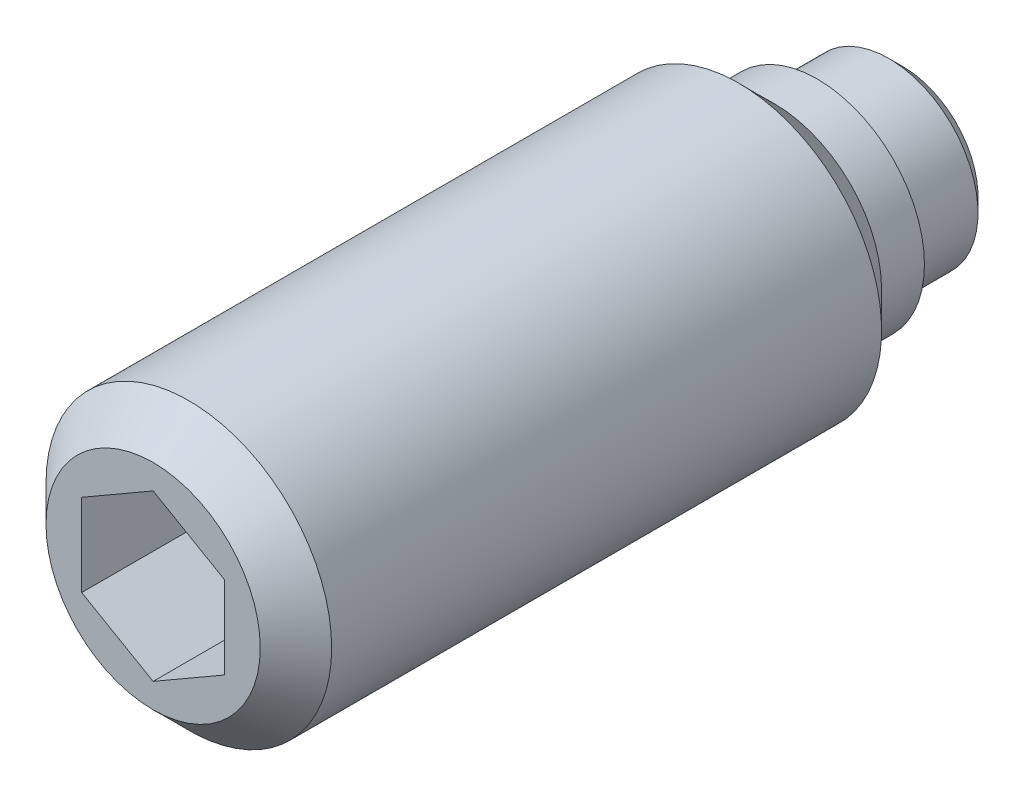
ISO-10303-21;
HEADER;
FILE_DESCRIPTION(('STEP AP214'),'2;1');
FILE_NAME('part.step','',(''),(''),'','','');
FILE_SCHEMA(('AUTOMOTIVE_DESIGN { 1 0 10303 214 1 1 1 1 }'));
ENDSEC;
DATA;
#1=APPLICATION_CONTEXT('core data for automotive mechanical design processes');
#2=APPLICATION_PROTOCOL_DEFINITION('international standard','automotive_design',2000,#1);
#3=PRODUCT_CONTEXT('',#1,'mechanical');
#4=PRODUCT('Part','Part','',(#3));
#5=PRODUCT_RELATED_PRODUCT_CATEGORY('part','',(#4));
#6=PRODUCT_DEFINITION_FORMATION('','',#4);
#7=PRODUCT_DEFINITION_CONTEXT('part definition',#1,'design');
#8=PRODUCT_DEFINITION('design','',#6,#7);
#9=PRODUCT_DEFINITION_SHAPE('','',#8);
#10=(LENGTH_UNIT() NAMED_UNIT(*) SI_UNIT(.MILLI.,.METRE.));
#11=(NAMED_UNIT(*) PLANE_ANGLE_UNIT() SI_UNIT($,.RADIAN.));
#12=(NAMED_UNIT(*) SI_UNIT($,.STERADIAN.) SOLID_ANGLE_UNIT());
#13=UNCERTAINTY_MEASURE_WITH_UNIT(LENGTH_MEASURE(1.E-05),#10,'distance_accuracy_value','');
#14=(GEOMETRIC_REPRESENTATION_CONTEXT(3) GLOBAL_UNCERTAINTY_ASSIGNED_CONTEXT((#13)) GLOBAL_UNIT_ASSIGNED_CONTEXT((#10,
#11,#12)) REPRESENTATION_CONTEXT('',''));
#15=CARTESIAN_POINT('',(0.,0.,0.));
#16=DIRECTION('',(0.,0.,1.));
#17=DIRECTION('',(1.,0.,0.));
#18=AXIS2_PLACEMENT_3D('',#15,#16,#17);
#19=CARTESIAN_POINT('',(0.,0.,1.2));
#20=DIRECTION('',(0.,0.,-1.));
#21=DIRECTION('',(-1.,0.,0.));
#22=AXIS2_PLACEMENT_3D('',#19,#20,#21);
#23=CYLINDRICAL_SURFACE('',#22,2.);
#24=CARTESIAN_POINT('',(0.,0.,2.3));
#25=DIRECTION('',(0.,0.,-1.));
#26=DIRECTION('',(-1.,0.,0.));
#27=AXIS2_PLACEMENT_3D('',#24,#25,#26);
#28=CIRCLE('',#27,2.);
#29=CARTESIAN_POINT('',(-2.,0.,2.3));
#30=VERTEX_POINT('',#29);
#31=EDGE_CURVE('E9',#30,#30,#28,.T.);
#32=ORIENTED_EDGE('',*,*,#31,.F.);
#33=EDGE_LOOP('',(#32));
#34=FACE_BOUND('',#33,.T.);
#35=CARTESIAN_POINT('',(0.,0.,10.));
#36=DIRECTION('',(0.,0.,1.));
#37=DIRECTION('',(1.,0.,0.));
#38=AXIS2_PLACEMENT_3D('',#35,#36,#37);
#39=CIRCLE('',#38,2.);
#40=CARTESIAN_POINT('',(2.,0.,10.));
#41=VERTEX_POINT('',#40);
#42=EDGE_CURVE('E70',#41,#41,#39,.T.);
#43=ORIENTED_EDGE('',*,*,#42,.F.);
#44=EDGE_LOOP('',(#43));
#45=FACE_BOUND('',#44,.T.);
#46=ADVANCED_FACE('F14',(#34,#45),#23,.T.);
#47=CARTESIAN_POINT('',(0.,0.,2.3));
#48=DIRECTION('',(0.,0.,1.));
#49=DIRECTION('',(1.,0.,0.));
#50=AXIS2_PLACEMENT_3D('',#47,#48,#49);
#51=CONICAL_SURFACE('',#50,2.,0.785398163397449);
#52=ORIENTED_EDGE('',*,*,#31,.T.);
#53=EDGE_LOOP('',(#52));
#54=FACE_BOUND('',#53,.T.);
#55=CARTESIAN_POINT('',(0.,0.,1.8));
#56=DIRECTION('',(0.,0.,-1.));
#57=DIRECTION('',(-1.,0.,0.));
#58=AXIS2_PLACEMENT_3D('',#55,#56,#57);
#59=CIRCLE('',#58,1.5);
#60=CARTESIAN_POINT('',(-1.5,0.,1.8));
#61=VERTEX_POINT('',#60);
#62=EDGE_CURVE('E21',#61,#61,#59,.T.);
#63=ORIENTED_EDGE('',*,*,#62,.F.);
#64=EDGE_LOOP('',(#63));
#65=FACE_BOUND('',#64,.T.);
#66=ADVANCED_FACE('F138',(#54,#65),#51,.T.);
#67=CARTESIAN_POINT('',(0.,0.,1.2));
#68=DIRECTION('',(0.,0.,-1.));
#69=DIRECTION('',(-1.,0.,0.));
#70=AXIS2_PLACEMENT_3D('',#67,#68,#69);
#71=CYLINDRICAL_SURFACE('',#70,1.5);
#72=CARTESIAN_POINT('',(0.,0.,1.2));
#73=DIRECTION('',(0.,0.,-1.));
#74=DIRECTION('',(-1.,0.,0.));
#75=AXIS2_PLACEMENT_3D('',#72,#73,#74);
#76=CIRCLE('',#75,1.5);
#77=CARTESIAN_POINT('',(-1.5,0.,1.2));
#78=VERTEX_POINT('',#77);
#79=EDGE_CURVE('E131',#78,#78,#76,.T.);
#80=ORIENTED_EDGE('',*,*,#79,.F.);
#81=EDGE_LOOP('',(#80));
#82=FACE_BOUND('',#81,.T.);
#83=ORIENTED_EDGE('',*,*,#62,.T.);
#84=EDGE_LOOP('',(#83));
#85=FACE_BOUND('',#84,.T.);
#86=ADVANCED_FACE('F136',(#82,#85),#71,.T.);
#87=CARTESIAN_POINT('',(0.,1.5,1.2));
#88=DIRECTION('',(0.,0.,1.));
#89=DIRECTION('',(1.,0.,0.));
#90=AXIS2_PLACEMENT_3D('',#87,#88,#89);
#91=PLANE('',#90);
#92=CARTESIAN_POINT('',(0.,0.,1.2));
#93=DIRECTION('',(0.,0.,-1.));
#94=DIRECTION('',(-1.,0.,0.));
#95=AXIS2_PLACEMENT_3D('',#92,#93,#94);
#96=CIRCLE('',#95,1.25);
#97=CARTESIAN_POINT('',(-1.25,0.,1.2));
#98=VERTEX_POINT('',#97);
#99=EDGE_CURVE('E128',#98,#98,#96,.T.);
#100=ORIENTED_EDGE('',*,*,#99,.F.);
#101=EDGE_LOOP('',(#100));
#102=FACE_BOUND('',#101,.T.);
#103=ORIENTED_EDGE('',*,*,#79,.T.);
#104=EDGE_LOOP('',(#103));
#105=FACE_BOUND('',#104,.T.);
#106=ADVANCED_FACE('F146',(#102,#105),#91,.F.);
#107=CARTESIAN_POINT('',(0.,0.,0.));
#108=DIRECTION('',(0.,0.,-1.));
#109=DIRECTION('',(-1.,0.,0.));
#110=AXIS2_PLACEMENT_3D('',#107,#108,#109);
#111=CYLINDRICAL_SURFACE('',#110,1.25);
#112=CARTESIAN_POINT('',(0.,0.,0.2));
#113=DIRECTION('',(0.,0.,-1.));
#114=DIRECTION('',(-1.,0.,0.));
#115=AXIS2_PLACEMENT_3D('',#112,#113,#114);
#116=CIRCLE('',#115,1.25);
#117=CARTESIAN_POINT('',(-1.25,0.,0.2));
#118=VERTEX_POINT('',#117);
#119=EDGE_CURVE('E125',#118,#118,#116,.T.);
#120=ORIENTED_EDGE('',*,*,#119,.F.);
#121=EDGE_LOOP('',(#120));
#122=FACE_BOUND('',#121,.T.);
#123=ORIENTED_EDGE('',*,*,#99,.T.);
#124=EDGE_LOOP('',(#123));
#125=FACE_BOUND('',#124,.T.);
#126=ADVANCED_FACE('F153',(#122,#125),#111,.T.);
#127=CARTESIAN_POINT('',(0.,0.,0.2));
#128=DIRECTION('',(0.,0.,1.));
#129=DIRECTION('',(1.,0.,0.));
#130=AXIS2_PLACEMENT_3D('',#127,#128,#129);
#131=CONICAL_SURFACE('',#130,1.25,0.785398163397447);
#132=CARTESIAN_POINT('',(0.,0.,0.));
#133=DIRECTION('',(0.,0.,-1.));
#134=DIRECTION('',(-1.,0.,0.));
#135=AXIS2_PLACEMENT_3D('',#132,#133,#134);
#136=CIRCLE('',#135,1.05);
#137=CARTESIAN_POINT('',(-1.05,0.,0.));
#138=VERTEX_POINT('',#137);
#139=EDGE_CURVE('E122',#138,#138,#136,.T.);
#140=ORIENTED_EDGE('',*,*,#139,.F.);
#141=EDGE_LOOP('',(#140));
#142=FACE_BOUND('',#141,.T.);
#143=ORIENTED_EDGE('',*,*,#119,.T.);
#144=EDGE_LOOP('',(#143));
#145=FACE_BOUND('',#144,.T.);
#146=ADVANCED_FACE('F157',(#142,#145),#131,.T.);
#147=CARTESIAN_POINT('',(0.,1.05,0.));
#148=DIRECTION('',(0.,0.,1.));
#149=DIRECTION('',(1.,0.,0.));
#150=AXIS2_PLACEMENT_3D('',#147,#148,#149);
#151=PLANE('',#150);
#152=ORIENTED_EDGE('',*,*,#139,.T.);
#153=EDGE_LOOP('',(#152));
#154=FACE_BOUND('',#153,.T.);
#155=ADVANCED_FACE('F161',(#154),#151,.F.);
#156=CARTESIAN_POINT('',(0.,0.,10.5));
#157=DIRECTION('',(0.,0.,1.));
#158=DIRECTION('',(1.,0.,0.));
#159=AXIS2_PLACEMENT_3D('',#156,#157,#158);
#160=PLANE('',#159);
#161=DIRECTION('',(0.866025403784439,-0.5,0.));
#162=VECTOR('',#161,1.);
#163=CARTESIAN_POINT('',(-1.,-0.577350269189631,10.5));
#164=LINE('',#163,#162);
#165=CARTESIAN_POINT('',(-1.,-0.577350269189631,10.5));
#166=VERTEX_POINT('',#165);
#167=CARTESIAN_POINT('',(0.,-1.15470053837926,10.5));
#168=VERTEX_POINT('',#167);
#169=EDGE_CURVE('E28',#166,#168,#164,.T.);
#170=ORIENTED_EDGE('',*,*,#169,.F.);
#171=DIRECTION('',(0.,-1.,0.));
#172=VECTOR('',#171,1.);
#173=CARTESIAN_POINT('',(-1.,0.577350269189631,10.5));
#174=LINE('',#173,#172);
#175=CARTESIAN_POINT('',(-1.,0.577350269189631,10.5));
#176=VERTEX_POINT('',#175);
#177=EDGE_CURVE('E69',#176,#166,#174,.T.);
#178=ORIENTED_EDGE('',*,*,#177,.F.);
#179=DIRECTION('',(-0.866025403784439,-0.5,0.));
#180=VECTOR('',#179,1.);
#181=CARTESIAN_POINT('',(0.,1.15470053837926,10.5));
#182=LINE('',#181,#180);
#183=CARTESIAN_POINT('',(0.,1.15470053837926,10.5));
#184=VERTEX_POINT('',#183);
#185=EDGE_CURVE('E105',#184,#176,#182,.T.);
#186=ORIENTED_EDGE('',*,*,#185,.F.);
#187=DIRECTION('',(-0.866025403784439,0.5,0.));
#188=VECTOR('',#187,1.);
#189=CARTESIAN_POINT('',(1.,0.577350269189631,10.5));
#190=LINE('',#189,#188);
#191=CARTESIAN_POINT('',(1.,0.577350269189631,10.5));
#192=VERTEX_POINT('',#191);
#193=EDGE_CURVE('E102',#192,#184,#190,.T.);
#194=ORIENTED_EDGE('',*,*,#193,.F.);
#195=DIRECTION('',(0.,1.,0.));
#196=VECTOR('',#195,1.);
#197=CARTESIAN_POINT('',(1.,-0.577350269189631,10.5));
#198=LINE('',#197,#196);
#199=CARTESIAN_POINT('',(1.,-0.577350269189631,10.5));
#200=VERTEX_POINT('',#199);
#201=EDGE_CURVE('E99',#200,#192,#198,.T.);
#202=ORIENTED_EDGE('',*,*,#201,.F.);
#203=DIRECTION('',(0.866025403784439,0.5,0.));
#204=VECTOR('',#203,1.);
#205=CARTESIAN_POINT('',(0.,-1.15470053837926,10.5));
#206=LINE('',#205,#204);
#207=EDGE_CURVE('E96',#168,#200,#206,.T.);
#208=ORIENTED_EDGE('',*,*,#207,.F.);
#209=EDGE_LOOP('',(#170,#178,#186,#194,#202,#208));
#210=FACE_BOUND('',#209,.T.);
#211=CARTESIAN_POINT('',(0.,0.,10.5));
#212=DIRECTION('',(0.,0.,1.));
#213=DIRECTION('',(1.,0.,0.));
#214=AXIS2_PLACEMENT_3D('',#211,#212,#213);
#215=CIRCLE('',#214,1.5);
#216=CARTESIAN_POINT('',(1.5,0.,10.5));
#217=VERTEX_POINT('',#216);
#218=EDGE_CURVE('E119',#217,#217,#215,.T.);
#219=ORIENTED_EDGE('',*,*,#218,.T.);
#220=EDGE_LOOP('',(#219));
#221=FACE_BOUND('',#220,.T.);
#222=ADVANCED_FACE('F165',(#210,#221),#160,.T.);
#223=CARTESIAN_POINT('',(0.,0.,10.5));
#224=DIRECTION('',(0.,0.,-1.));
#225=DIRECTION('',(-1.,0.,0.));
#226=AXIS2_PLACEMENT_3D('',#223,#224,#225);
#227=CONICAL_SURFACE('',#226,1.5,0.785398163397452);
#228=ORIENTED_EDGE('',*,*,#42,.T.);
#229=EDGE_LOOP('',(#228));
#230=FACE_BOUND('',#229,.T.);
#231=ORIENTED_EDGE('',*,*,#218,.F.);
#232=EDGE_LOOP('',(#231));
#233=FACE_BOUND('',#232,.T.);
#234=ADVANCED_FACE('F169',(#230,#233),#227,.T.);
#235=CARTESIAN_POINT('',(-1.,-0.577350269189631,8.5));
#236=DIRECTION('',(-0.5,-0.866025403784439,0.));
#237=DIRECTION('',(0.866025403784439,-0.5,0.));
#238=AXIS2_PLACEMENT_3D('',#235,#236,#237);
#239=PLANE('',#238);
#240=ORIENTED_EDGE('',*,*,#169,.T.);
#241=DIRECTION('',(0.,0.,1.));
#242=VECTOR('',#241,1.);
#243=CARTESIAN_POINT('',(0.,-1.15470053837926,8.5));
#244=LINE('',#243,#242);
#245=CARTESIAN_POINT('',(0.,-1.15470053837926,8.));
#246=VERTEX_POINT('',#245);
#247=EDGE_CURVE('E76',#246,#168,#244,.T.);
#248=ORIENTED_EDGE('',*,*,#247,.F.);
#249=DIRECTION('',(0.866025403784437,-0.5,0.));
#250=VECTOR('',#249,1.);
#251=CARTESIAN_POINT('',(-1.,-0.577350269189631,8.));
#252=LINE('',#251,#250);
#253=CARTESIAN_POINT('',(-1.,-0.577350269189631,8.));
#254=VERTEX_POINT('',#253);
#255=EDGE_CURVE('E74',#254,#246,#252,.T.);
#256=ORIENTED_EDGE('',*,*,#255,.F.);
#257=DIRECTION('',(0.,0.,1.));
#258=VECTOR('',#257,1.);
#259=CARTESIAN_POINT('',(-1.,-0.577350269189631,8.5));
#260=LINE('',#259,#258);
#261=EDGE_CURVE('E33',#254,#166,#260,.T.);
#262=ORIENTED_EDGE('',*,*,#261,.T.);
#263=EDGE_LOOP('',(#240,#248,#256,#262));
#264=FACE_BOUND('',#263,.T.);
#265=ADVANCED_FACE('F75',(#264),#239,.F.);
#266=CARTESIAN_POINT('',(-1.,0.577350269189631,8.5));
#267=DIRECTION('',(-1.,0.,0.));
#268=DIRECTION('',(0.,0.,1.));
#269=AXIS2_PLACEMENT_3D('',#266,#267,#268);
#270=PLANE('',#269);
#271=ORIENTED_EDGE('',*,*,#177,.T.);
#272=ORIENTED_EDGE('',*,*,#261,.F.);
#273=DIRECTION('',(0.,-1.,0.));
#274=VECTOR('',#273,1.);
#275=CARTESIAN_POINT('',(-1.,0.577350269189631,8.));
#276=LINE('',#275,#274);
#277=CARTESIAN_POINT('',(-1.,0.577350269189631,8.));
#278=VERTEX_POINT('',#277);
#279=EDGE_CURVE('E66',#278,#254,#276,.T.);
#280=ORIENTED_EDGE('',*,*,#279,.F.);
#281=DIRECTION('',(0.,0.,1.));
#282=VECTOR('',#281,1.);
#283=CARTESIAN_POINT('',(-1.,0.577350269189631,8.5));
#284=LINE('',#283,#282);
#285=EDGE_CURVE('E71',#278,#176,#284,.T.);
#286=ORIENTED_EDGE('',*,*,#285,.T.);
#287=EDGE_LOOP('',(#271,#272,#280,#286));
#288=FACE_BOUND('',#287,.T.);
#289=ADVANCED_FACE('F64',(#288),#270,.F.);
#290=CARTESIAN_POINT('',(0.,1.15470053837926,8.5));
#291=DIRECTION('',(-0.5,0.866025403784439,0.));
#292=DIRECTION('',(-0.866025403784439,-0.5,0.));
#293=AXIS2_PLACEMENT_3D('',#290,#291,#292);
#294=PLANE('',#293);
#295=ORIENTED_EDGE('',*,*,#185,.T.);
#296=ORIENTED_EDGE('',*,*,#285,.F.);
#297=DIRECTION('',(-0.866025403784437,-0.5,0.));
#298=VECTOR('',#297,1.);
#299=CARTESIAN_POINT('',(0.,1.15470053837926,8.));
#300=LINE('',#299,#298);
#301=CARTESIAN_POINT('',(0.,1.15470053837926,8.));
#302=VERTEX_POINT('',#301);
#303=EDGE_CURVE('E85',#302,#278,#300,.T.);
#304=ORIENTED_EDGE('',*,*,#303,.F.);
#305=DIRECTION('',(0.,0.,1.));
#306=VECTOR('',#305,1.);
#307=CARTESIAN_POINT('',(0.,1.15470053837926,8.5));
#308=LINE('',#307,#306);
#309=EDGE_CURVE('E110',#302,#184,#308,.T.);
#310=ORIENTED_EDGE('',*,*,#309,.T.);
#311=EDGE_LOOP('',(#295,#296,#304,#310));
#312=FACE_BOUND('',#311,.T.);
#313=ADVANCED_FACE('F187',(#312),#294,.F.);
#314=CARTESIAN_POINT('',(1.,0.577350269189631,8.5));
#315=DIRECTION('',(0.5,0.866025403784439,0.));
#316=DIRECTION('',(-0.866025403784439,0.5,0.));
#317=AXIS2_PLACEMENT_3D('',#314,#315,#316);
#318=PLANE('',#317);
#319=ORIENTED_EDGE('',*,*,#193,.T.);
#320=ORIENTED_EDGE('',*,*,#309,.F.);
#321=DIRECTION('',(-0.866025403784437,0.5,0.));
#322=VECTOR('',#321,1.);
#323=CARTESIAN_POINT('',(1.,0.577350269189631,8.));
#324=LINE('',#323,#322);
#325=CARTESIAN_POINT('',(1.,0.577350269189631,8.));
#326=VERTEX_POINT('',#325);
#327=EDGE_CURVE('E92',#326,#302,#324,.T.);
#328=ORIENTED_EDGE('',*,*,#327,.F.);
#329=DIRECTION('',(0.,0.,1.));
#330=VECTOR('',#329,1.);
#331=CARTESIAN_POINT('',(1.,0.577350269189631,8.5));
#332=LINE('',#331,#330);
#333=EDGE_CURVE('E112',#326,#192,#332,.T.);
#334=ORIENTED_EDGE('',*,*,#333,.T.);
#335=EDGE_LOOP('',(#319,#320,#328,#334));
#336=FACE_BOUND('',#335,.T.);
#337=ADVANCED_FACE('F183',(#336),#318,.F.);
#338=CARTESIAN_POINT('',(1.,-0.577350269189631,8.5));
#339=DIRECTION('',(1.,0.,0.));
#340=DIRECTION('',(0.,0.,-1.));
#341=AXIS2_PLACEMENT_3D('',#338,#339,#340);
#342=PLANE('',#341);
#343=ORIENTED_EDGE('',*,*,#201,.T.);
#344=ORIENTED_EDGE('',*,*,#333,.F.);
#345=DIRECTION('',(0.,1.,0.));
#346=VECTOR('',#345,1.);
#347=CARTESIAN_POINT('',(1.,-0.577350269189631,8.));
#348=LINE('',#347,#346);
#349=CARTESIAN_POINT('',(1.,-0.577350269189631,8.));
#350=VERTEX_POINT('',#349);
#351=EDGE_CURVE('E89',#350,#326,#348,.T.);
#352=ORIENTED_EDGE('',*,*,#351,.F.);
#353=DIRECTION('',(0.,0.,1.));
#354=VECTOR('',#353,1.);
#355=CARTESIAN_POINT('',(1.,-0.577350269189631,8.5));
#356=LINE('',#355,#354);
#357=EDGE_CURVE('E114',#350,#200,#356,.T.);
#358=ORIENTED_EDGE('',*,*,#357,.T.);
#359=EDGE_LOOP('',(#343,#344,#352,#358));
#360=FACE_BOUND('',#359,.T.);
#361=ADVANCED_FACE('F179',(#360),#342,.F.);
#362=CARTESIAN_POINT('',(0.,-1.15470053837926,8.5));
#363=DIRECTION('',(0.5,-0.866025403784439,0.));
#364=DIRECTION('',(0.866025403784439,0.5,0.));
#365=AXIS2_PLACEMENT_3D('',#362,#363,#364);
#366=PLANE('',#365);
#367=ORIENTED_EDGE('',*,*,#207,.T.);
#368=ORIENTED_EDGE('',*,*,#357,.F.);
#369=DIRECTION('',(0.866025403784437,0.5,0.));
#370=VECTOR('',#369,1.);
#371=CARTESIAN_POINT('',(0.,-1.15470053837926,8.));
#372=LINE('',#371,#370);
#373=EDGE_CURVE('E80',#246,#350,#372,.T.);
#374=ORIENTED_EDGE('',*,*,#373,.F.);
#375=ORIENTED_EDGE('',*,*,#247,.T.);
#376=EDGE_LOOP('',(#367,#368,#374,#375));
#377=FACE_BOUND('',#376,.T.);
#378=ADVANCED_FACE('F176',(#377),#366,.F.);
#379=CARTESIAN_POINT('',(0.,0.,8.));
#380=DIRECTION('',(0.,0.,1.));
#381=DIRECTION('',(1.,0.,0.));
#382=AXIS2_PLACEMENT_3D('',#379,#380,#381);
#383=PLANE('',#382);
#384=ORIENTED_EDGE('',*,*,#279,.T.);
#385=ORIENTED_EDGE('',*,*,#255,.T.);
#386=ORIENTED_EDGE('',*,*,#373,.T.);
#387=ORIENTED_EDGE('',*,*,#351,.T.);
#388=ORIENTED_EDGE('',*,*,#327,.T.);
#389=ORIENTED_EDGE('',*,*,#303,.T.);
#390=EDGE_LOOP('',(#384,#385,#386,#387,#388,#389));
#391=FACE_BOUND('',#390,.T.);
#392=ADVANCED_FACE('F82',(#391),#383,.T.);
#393=CLOSED_SHELL('',(#46,#66,#86,#106,#126,#146,#155,#222,#234,#265,#289,#313,#337,#361,#378,#392));
#394=MANIFOLD_SOLID_BREP('B1',#393);
#395=ADVANCED_BREP_SHAPE_REPRESENTATION('',(#18,#394),#14);
#396=SHAPE_DEFINITION_REPRESENTATION(#9,#395);
ENDSEC;
END-ISO-10303-21;
